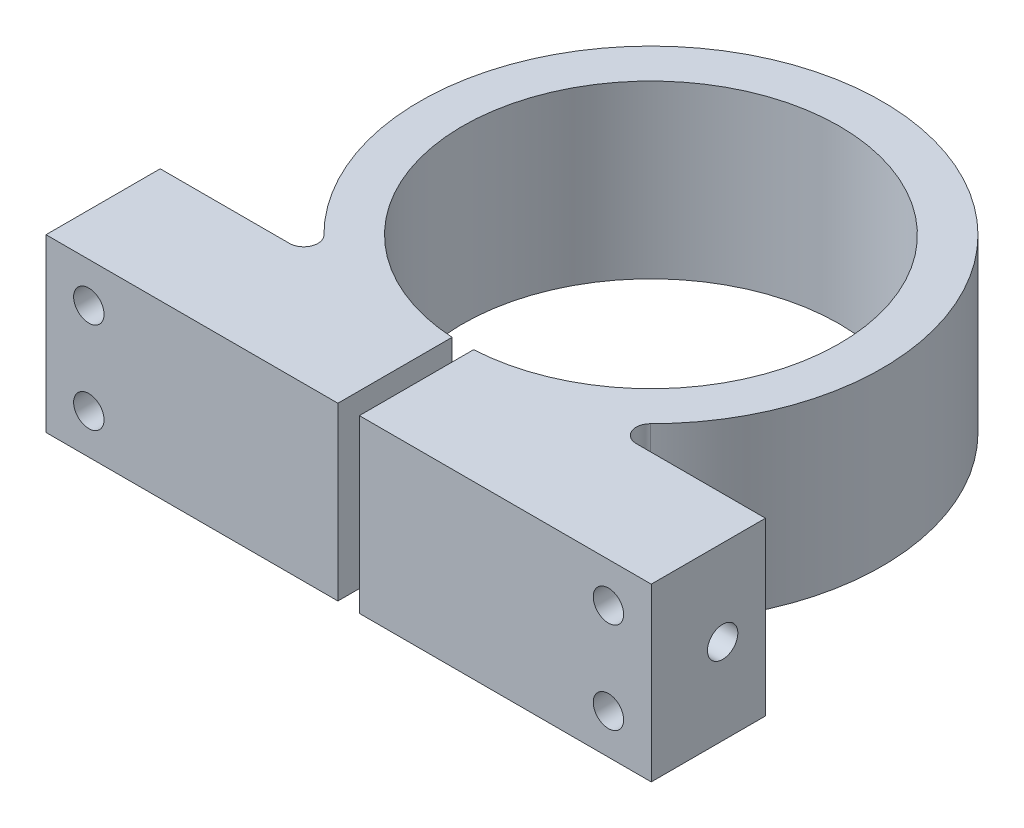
from build123d import *

# Parameters (mm, degrees)
EXTRUDE1_DEPTH          = 38.1
F_1_4_CLEARANCE_HOLE2_D = 6.7564
F_1_4_CLEARANCE_HOLE1_D = 6.7564
F_1_4_CLEARANCE_HOLE3_D = 6.7564
LPATTERN1_COUNT         = 2
LPATTERN1_PITCH         = 20.32


with BuildPart() as part:
    # Sketch1 → Extrude1 (new body)
    with BuildSketch(Plane(origin=(0, 0, 0), x_dir=(1, 0, 0), z_dir=(0, 1, 0))):
        with BuildLine():
            Line((2.3876, -67.241934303), (67.31, -67.241934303))
            Line((67.31, -67.241934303), (67.31, -41.841934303))
            Line((67.31, -41.841934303), (38.563198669, -41.841934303))
            ThreePointArc((38.563198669, -41.841934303), (35.629065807, -39.87998391), (36.321152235, -36.418856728))
            ThreePointArc((36.321152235, -36.418856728), (0, 51.435), (-36.321152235, -36.418856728))
            ThreePointArc((-36.321152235, -36.418856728), (-35.629065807, -39.87998391), (-38.563198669, -41.841934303))
            Line((-38.563198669, -41.841934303), (-67.31, -41.841934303))
            Line((-67.31, -41.841934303), (-67.31, -67.241934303))
            Line((-67.31, -67.241934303), (-2.3876, -67.241934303))
            Line((-2.3876, -67.241934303), (-2.3876, -41.841934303))
            ThreePointArc((-2.3876, -41.841934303), (0, 41.91), (2.3876, -41.841934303))
            Line((2.3876, -41.841934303), (2.3876, -67.241934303))
        make_face()
    extrude(amount=EXTRUDE1_DEPTH)

    # 1_4 Clearance Hole2 (through all)
    with Locations(Plane(origin=(-67.31, 19.05, 51.366934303), x_dir=(0, 0, -1), z_dir=(-1, 0, 0))):
        with Locations((0, 0)):
            Hole(F_1_4_CLEARANCE_HOLE2_D / 2)

    # 1_4 Clearance Hole1 (through all)
    with Locations(Plane(origin=(-57.785, 29.21, 41.841934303), x_dir=(-1, 0, 0), z_dir=(0, 0, -1))):
        with Locations((0, 0)):
            f_1_4_clearance_hole1 = Hole(F_1_4_CLEARANCE_HOLE1_D / 2)

    # 1_4 Clearance Hole3 (through all)
    with Locations(Plane(origin=(57.785, 29.21, 41.841934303), x_dir=(-1, 0, 0), z_dir=(0, 0, -1))):
        with Locations((0, 0)):
            f_1_4_clearance_hole3 = Hole(F_1_4_CLEARANCE_HOLE3_D / 2)

    # LPattern1: 1_4 Clearance Hole1, 1_4 Clearance Hole3 ×2
    with Locations(*[(0, -i * LPATTERN1_PITCH, 0) for i in range(1, LPATTERN1_COUNT)]):
        add(f_1_4_clearance_hole1, mode=Mode.SUBTRACT)
        add(f_1_4_clearance_hole3, mode=Mode.SUBTRACT)


solid = part.part
